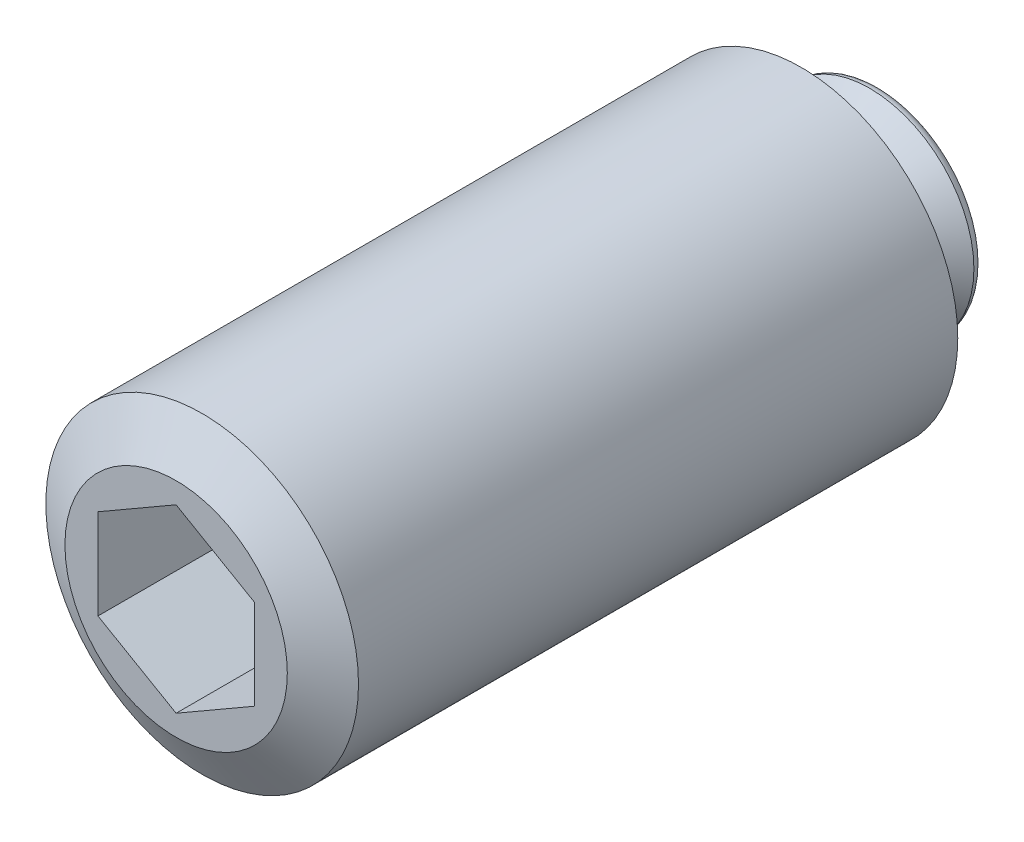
ISO-10303-21;
HEADER;
FILE_DESCRIPTION(('STEP AP214'),'2;1');
FILE_NAME('part.step','',(''),(''),'','','');
FILE_SCHEMA(('AUTOMOTIVE_DESIGN { 1 0 10303 214 1 1 1 1 }'));
ENDSEC;
DATA;
#1=APPLICATION_CONTEXT('core data for automotive mechanical design processes');
#2=APPLICATION_PROTOCOL_DEFINITION('international standard','automotive_design',2000,#1);
#3=PRODUCT_CONTEXT('',#1,'mechanical');
#4=PRODUCT('Part','Part','',(#3));
#5=PRODUCT_RELATED_PRODUCT_CATEGORY('part','',(#4));
#6=PRODUCT_DEFINITION_FORMATION('','',#4);
#7=PRODUCT_DEFINITION_CONTEXT('part definition',#1,'design');
#8=PRODUCT_DEFINITION('design','',#6,#7);
#9=PRODUCT_DEFINITION_SHAPE('','',#8);
#10=(LENGTH_UNIT() NAMED_UNIT(*) SI_UNIT(.MILLI.,.METRE.));
#11=(NAMED_UNIT(*) PLANE_ANGLE_UNIT() SI_UNIT($,.RADIAN.));
#12=(NAMED_UNIT(*) SI_UNIT($,.STERADIAN.) SOLID_ANGLE_UNIT());
#13=UNCERTAINTY_MEASURE_WITH_UNIT(LENGTH_MEASURE(1.E-05),#10,'distance_accuracy_value','');
#14=(GEOMETRIC_REPRESENTATION_CONTEXT(3) GLOBAL_UNCERTAINTY_ASSIGNED_CONTEXT((#13)) GLOBAL_UNIT_ASSIGNED_CONTEXT((#10,
#11,#12)) REPRESENTATION_CONTEXT('',''));
#15=CARTESIAN_POINT('',(0.,0.,0.));
#16=DIRECTION('',(0.,0.,1.));
#17=DIRECTION('',(1.,0.,0.));
#18=AXIS2_PLACEMENT_3D('',#15,#16,#17);
#19=CARTESIAN_POINT('',(0.,4.267949,27.));
#20=DIRECTION('',(0.,0.,1.));
#21=DIRECTION('',(1.,0.,0.));
#22=AXIS2_PLACEMENT_3D('',#19,#20,#21);
#23=PLANE('',#22);
#24=DIRECTION('',(-0.866025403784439,0.5,0.));
#25=VECTOR('',#24,1.);
#26=CARTESIAN_POINT('',(3.,1.73205080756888,27.));
#27=LINE('',#26,#25);
#28=CARTESIAN_POINT('',(3.,1.73205080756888,27.));
#29=VERTEX_POINT('',#28);
#30=CARTESIAN_POINT('',(0.,3.46410161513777,27.));
#31=VERTEX_POINT('',#30);
#32=EDGE_CURVE('E28',#29,#31,#27,.T.);
#33=ORIENTED_EDGE('',*,*,#32,.F.);
#34=DIRECTION('',(0.,1.,0.));
#35=VECTOR('',#34,1.);
#36=CARTESIAN_POINT('',(3.,-1.73205080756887,27.));
#37=LINE('',#36,#35);
#38=CARTESIAN_POINT('',(3.,-1.73205080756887,27.));
#39=VERTEX_POINT('',#38);
#40=EDGE_CURVE('E111',#39,#29,#37,.T.);
#41=ORIENTED_EDGE('',*,*,#40,.F.);
#42=DIRECTION('',(0.866025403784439,0.5,0.));
#43=VECTOR('',#42,1.);
#44=CARTESIAN_POINT('',(0.,-3.46410161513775,27.));
#45=LINE('',#44,#43);
#46=CARTESIAN_POINT('',(0.,-3.46410161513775,27.));
#47=VERTEX_POINT('',#46);
#48=EDGE_CURVE('E109',#47,#39,#45,.T.);
#49=ORIENTED_EDGE('',*,*,#48,.F.);
#50=DIRECTION('',(0.866025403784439,-0.5,0.));
#51=VECTOR('',#50,1.);
#52=CARTESIAN_POINT('',(-3.,-1.73205080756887,27.));
#53=LINE('',#52,#51);
#54=CARTESIAN_POINT('',(-3.,-1.73205080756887,27.));
#55=VERTEX_POINT('',#54);
#56=EDGE_CURVE('E76',#55,#47,#53,.T.);
#57=ORIENTED_EDGE('',*,*,#56,.F.);
#58=DIRECTION('',(0.,-1.,0.));
#59=VECTOR('',#58,1.);
#60=CARTESIAN_POINT('',(-3.,1.73205080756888,27.));
#61=LINE('',#60,#59);
#62=CARTESIAN_POINT('',(-3.,1.73205080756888,27.));
#63=VERTEX_POINT('',#62);
#64=EDGE_CURVE('E105',#63,#55,#61,.T.);
#65=ORIENTED_EDGE('',*,*,#64,.F.);
#66=DIRECTION('',(-0.866025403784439,-0.5,0.));
#67=VECTOR('',#66,1.);
#68=CARTESIAN_POINT('',(0.,3.46410161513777,27.));
#69=LINE('',#68,#67);
#70=EDGE_CURVE('E102',#31,#63,#69,.T.);
#71=ORIENTED_EDGE('',*,*,#70,.F.);
#72=EDGE_LOOP('',(#33,#41,#49,#57,#65,#71));
#73=FACE_BOUND('',#72,.T.);
#74=CARTESIAN_POINT('',(0.,0.,27.));
#75=DIRECTION('',(0.,0.,1.));
#76=DIRECTION('',(1.,0.,0.));
#77=AXIS2_PLACEMENT_3D('',#74,#75,#76);
#78=CIRCLE('',#77,4.267949);
#79=CARTESIAN_POINT('',(4.267949,0.,27.));
#80=VERTEX_POINT('',#79);
#81=EDGE_CURVE('E9',#80,#80,#78,.T.);
#82=ORIENTED_EDGE('',*,*,#81,.T.);
#83=EDGE_LOOP('',(#82));
#84=FACE_BOUND('',#83,.T.);
#85=ADVANCED_FACE('F14',(#73,#84),#23,.T.);
#86=CARTESIAN_POINT('',(0.,0.,27.));
#87=DIRECTION('',(0.,0.,-1.));
#88=DIRECTION('',(-1.,0.,0.));
#89=AXIS2_PLACEMENT_3D('',#86,#87,#88);
#90=CONICAL_SURFACE('',#89,4.267949,1.04719759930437);
#91=CARTESIAN_POINT('',(0.,0.,26.));
#92=DIRECTION('',(0.,0.,1.));
#93=DIRECTION('',(1.,0.,0.));
#94=AXIS2_PLACEMENT_3D('',#91,#92,#93);
#95=CIRCLE('',#94,6.);
#96=CARTESIAN_POINT('',(6.,0.,26.));
#97=VERTEX_POINT('',#96);
#98=EDGE_CURVE('E21',#97,#97,#95,.T.);
#99=ORIENTED_EDGE('',*,*,#98,.T.);
#100=EDGE_LOOP('',(#99));
#101=FACE_BOUND('',#100,.T.);
#102=ORIENTED_EDGE('',*,*,#81,.F.);
#103=EDGE_LOOP('',(#102));
#104=FACE_BOUND('',#103,.T.);
#105=ADVANCED_FACE('F143',(#101,#104),#90,.T.);
#106=CARTESIAN_POINT('',(0.,0.,30.));
#107=DIRECTION('',(0.,0.,1.));
#108=DIRECTION('',(1.,0.,0.));
#109=AXIS2_PLACEMENT_3D('',#106,#107,#108);
#110=CYLINDRICAL_SURFACE('',#109,6.);
#111=CARTESIAN_POINT('',(0.,0.,3.));
#112=DIRECTION('',(0.,0.,1.));
#113=DIRECTION('',(1.,0.,0.));
#114=AXIS2_PLACEMENT_3D('',#111,#112,#113);
#115=CIRCLE('',#114,6.);
#116=CARTESIAN_POINT('',(6.,0.,3.));
#117=VERTEX_POINT('',#116);
#118=EDGE_CURVE('E138',#117,#117,#115,.T.);
#119=ORIENTED_EDGE('',*,*,#118,.T.);
#120=EDGE_LOOP('',(#119));
#121=FACE_BOUND('',#120,.T.);
#122=ORIENTED_EDGE('',*,*,#98,.F.);
#123=EDGE_LOOP('',(#122));
#124=FACE_BOUND('',#123,.T.);
#125=ADVANCED_FACE('F146',(#121,#124),#110,.T.);
#126=CARTESIAN_POINT('',(0.,0.,3.));
#127=DIRECTION('',(0.,0.,1.));
#128=DIRECTION('',(1.,0.,0.));
#129=AXIS2_PLACEMENT_3D('',#126,#127,#128);
#130=CONICAL_SURFACE('',#129,6.,1.04719759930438);
#131=CARTESIAN_POINT('',(0.,0.,2.));
#132=DIRECTION('',(0.,0.,1.));
#133=DIRECTION('',(1.,0.,0.));
#134=AXIS2_PLACEMENT_3D('',#131,#132,#133);
#135=CIRCLE('',#134,4.267949);
#136=CARTESIAN_POINT('',(4.267949,0.,2.));
#137=VERTEX_POINT('',#136);
#138=EDGE_CURVE('E135',#137,#137,#135,.T.);
#139=ORIENTED_EDGE('',*,*,#138,.T.);
#140=EDGE_LOOP('',(#139));
#141=FACE_BOUND('',#140,.T.);
#142=ORIENTED_EDGE('',*,*,#118,.F.);
#143=EDGE_LOOP('',(#142));
#144=FACE_BOUND('',#143,.T.);
#145=ADVANCED_FACE('F148',(#141,#144),#130,.T.);
#146=CARTESIAN_POINT('',(0.,4.267949,2.));
#147=DIRECTION('',(0.,0.,-1.));
#148=DIRECTION('',(-1.,0.,0.));
#149=AXIS2_PLACEMENT_3D('',#146,#147,#148);
#150=PLANE('',#149);
#151=CARTESIAN_POINT('',(0.,0.,2.));
#152=DIRECTION('',(0.,0.,1.));
#153=DIRECTION('',(1.,0.,0.));
#154=AXIS2_PLACEMENT_3D('',#151,#152,#153);
#155=CIRCLE('',#154,3.);
#156=CARTESIAN_POINT('',(3.,0.,2.));
#157=VERTEX_POINT('',#156);
#158=EDGE_CURVE('E132',#157,#157,#155,.T.);
#159=ORIENTED_EDGE('',*,*,#158,.T.);
#160=EDGE_LOOP('',(#159));
#161=FACE_BOUND('',#160,.T.);
#162=ORIENTED_EDGE('',*,*,#138,.F.);
#163=EDGE_LOOP('',(#162));
#164=FACE_BOUND('',#163,.T.);
#165=ADVANCED_FACE('F157',(#161,#164),#150,.T.);
#166=CARTESIAN_POINT('',(0.,0.,30.));
#167=DIRECTION('',(0.,0.,1.));
#168=DIRECTION('',(1.,0.,0.));
#169=AXIS2_PLACEMENT_3D('',#166,#167,#168);
#170=CYLINDRICAL_SURFACE('',#169,3.);
#171=CARTESIAN_POINT('',(0.,0.,1.48621024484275));
#172=DIRECTION('',(0.,0.,1.));
#173=DIRECTION('',(1.,0.,0.));
#174=AXIS2_PLACEMENT_3D('',#171,#172,#173);
#175=CIRCLE('',#174,3.);
#176=CARTESIAN_POINT('',(3.,0.,1.48621024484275));
#177=VERTEX_POINT('',#176);
#178=EDGE_CURVE('E129',#177,#177,#175,.T.);
#179=ORIENTED_EDGE('',*,*,#178,.T.);
#180=EDGE_LOOP('',(#179));
#181=FACE_BOUND('',#180,.T.);
#182=ORIENTED_EDGE('',*,*,#158,.F.);
#183=EDGE_LOOP('',(#182));
#184=FACE_BOUND('',#183,.T.);
#185=ADVANCED_FACE('F200',(#181,#184),#170,.T.);
#186=CARTESIAN_POINT('',(0.,0.,1.48621024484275));
#187=DIRECTION('',(0.,0.,1.));
#188=DIRECTION('',(1.,0.,0.));
#189=AXIS2_PLACEMENT_3D('',#186,#187,#188);
#190=TOROIDAL_SURFACE('',#189,3.254,0.254000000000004);
#191=CARTESIAN_POINT('',(0.,0.,1.3066051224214));
#192=DIRECTION('',(0.,0.,1.));
#193=DIRECTION('',(1.,0.,0.));
#194=AXIS2_PLACEMENT_3D('',#191,#192,#193);
#195=CIRCLE('',#194,3.07439487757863);
#196=CARTESIAN_POINT('',(3.07439487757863,0.,1.3066051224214));
#197=VERTEX_POINT('',#196);
#198=EDGE_CURVE('E126',#197,#197,#195,.T.);
#199=ORIENTED_EDGE('',*,*,#198,.T.);
#200=EDGE_LOOP('',(#199));
#201=FACE_BOUND('',#200,.T.);
#202=ORIENTED_EDGE('',*,*,#178,.F.);
#203=EDGE_LOOP('',(#202));
#204=FACE_BOUND('',#203,.T.);
#205=ADVANCED_FACE('F196',(#201,#204),#190,.F.);
#206=CARTESIAN_POINT('',(0.,0.,1.3066051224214));
#207=DIRECTION('',(0.,0.,-1.));
#208=DIRECTION('',(-1.,0.,0.));
#209=AXIS2_PLACEMENT_3D('',#206,#207,#208);
#210=CONICAL_SURFACE('',#209,3.07439487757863,0.785398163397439);
#211=CARTESIAN_POINT('',(0.,0.,0.381));
#212=DIRECTION('',(0.,0.,1.));
#213=DIRECTION('',(1.,0.,0.));
#214=AXIS2_PLACEMENT_3D('',#211,#212,#213);
#215=CIRCLE('',#214,4.);
#216=CARTESIAN_POINT('',(4.,0.,0.381));
#217=VERTEX_POINT('',#216);
#218=EDGE_CURVE('E123',#217,#217,#215,.T.);
#219=ORIENTED_EDGE('',*,*,#218,.T.);
#220=EDGE_LOOP('',(#219));
#221=FACE_BOUND('',#220,.T.);
#222=ORIENTED_EDGE('',*,*,#198,.F.);
#223=EDGE_LOOP('',(#222));
#224=FACE_BOUND('',#223,.T.);
#225=ADVANCED_FACE('F192',(#221,#224),#210,.T.);
#226=CARTESIAN_POINT('',(0.,0.,0.381));
#227=DIRECTION('',(0.,0.,1.));
#228=DIRECTION('',(1.,0.,0.));
#229=AXIS2_PLACEMENT_3D('',#226,#227,#228);
#230=TOROIDAL_SURFACE('',#229,3.619,0.381);
#231=CARTESIAN_POINT('',(0.,0.,0.));
#232=DIRECTION('',(0.,0.,1.));
#233=DIRECTION('',(1.,0.,0.));
#234=AXIS2_PLACEMENT_3D('',#231,#232,#233);
#235=CIRCLE('',#234,3.619);
#236=CARTESIAN_POINT('',(3.619,0.,0.));
#237=VERTEX_POINT('',#236);
#238=EDGE_CURVE('E115',#237,#237,#235,.T.);
#239=ORIENTED_EDGE('',*,*,#238,.T.);
#240=EDGE_LOOP('',(#239));
#241=FACE_BOUND('',#240,.T.);
#242=ORIENTED_EDGE('',*,*,#218,.F.);
#243=EDGE_LOOP('',(#242));
#244=FACE_BOUND('',#243,.T.);
#245=ADVANCED_FACE('F184',(#241,#244),#230,.T.);
#246=CARTESIAN_POINT('',(0.,0.,0.));
#247=DIRECTION('',(0.,0.,-1.));
#248=DIRECTION('',(-1.,0.,0.));
#249=AXIS2_PLACEMENT_3D('',#246,#247,#248);
#250=PLANE('',#249);
#251=ORIENTED_EDGE('',*,*,#238,.F.);
#252=EDGE_LOOP('',(#251));
#253=FACE_BOUND('',#252,.T.);
#254=ADVANCED_FACE('F176',(#253),#250,.T.);
#255=CARTESIAN_POINT('',(3.,1.73205080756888,22.));
#256=DIRECTION('',(0.5,0.866025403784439,0.));
#257=DIRECTION('',(0.866025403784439,-0.5,0.));
#258=AXIS2_PLACEMENT_3D('',#255,#256,#257);
#259=PLANE('',#258);
#260=ORIENTED_EDGE('',*,*,#32,.T.);
#261=DIRECTION('',(0.,0.,1.));
#262=VECTOR('',#261,1.);
#263=CARTESIAN_POINT('',(0.,3.46410161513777,22.));
#264=LINE('',#263,#262);
#265=CARTESIAN_POINT('',(0.,3.46410161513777,22.));
#266=VERTEX_POINT('',#265);
#267=EDGE_CURVE('E58',#266,#31,#264,.T.);
#268=ORIENTED_EDGE('',*,*,#267,.F.);
#269=DIRECTION('',(-0.866025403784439,0.5,0.));
#270=VECTOR('',#269,1.);
#271=CARTESIAN_POINT('',(3.,1.73205080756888,22.));
#272=LINE('',#271,#270);
#273=CARTESIAN_POINT('',(3.,1.73205080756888,22.));
#274=VERTEX_POINT('',#273);
#275=EDGE_CURVE('E113',#274,#266,#272,.T.);
#276=ORIENTED_EDGE('',*,*,#275,.F.);
#277=DIRECTION('',(0.,0.,1.));
#278=VECTOR('',#277,1.);
#279=CARTESIAN_POINT('',(3.,1.73205080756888,22.));
#280=LINE('',#279,#278);
#281=EDGE_CURVE('E36',#274,#29,#280,.T.);
#282=ORIENTED_EDGE('',*,*,#281,.T.);
#283=EDGE_LOOP('',(#260,#268,#276,#282));
#284=FACE_BOUND('',#283,.T.);
#285=ADVANCED_FACE('F173',(#284),#259,.F.);
#286=CARTESIAN_POINT('',(3.,-1.73205080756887,22.));
#287=DIRECTION('',(1.,0.,0.));
#288=DIRECTION('',(0.,0.,-1.));
#289=AXIS2_PLACEMENT_3D('',#286,#287,#288);
#290=PLANE('',#289);
#291=ORIENTED_EDGE('',*,*,#40,.T.);
#292=ORIENTED_EDGE('',*,*,#281,.F.);
#293=DIRECTION('',(0.,1.,0.));
#294=VECTOR('',#293,1.);
#295=CARTESIAN_POINT('',(3.,-1.73205080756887,22.));
#296=LINE('',#295,#294);
#297=CARTESIAN_POINT('',(3.,-1.73205080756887,22.));
#298=VERTEX_POINT('',#297);
#299=EDGE_CURVE('E88',#298,#274,#296,.T.);
#300=ORIENTED_EDGE('',*,*,#299,.F.);
#301=DIRECTION('',(0.,0.,1.));
#302=VECTOR('',#301,1.);
#303=CARTESIAN_POINT('',(3.,-1.73205080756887,22.));
#304=LINE('',#303,#302);
#305=EDGE_CURVE('E80',#298,#39,#304,.T.);
#306=ORIENTED_EDGE('',*,*,#305,.T.);
#307=EDGE_LOOP('',(#291,#292,#300,#306));
#308=FACE_BOUND('',#307,.T.);
#309=ADVANCED_FACE('F175',(#308),#290,.F.);
#310=CARTESIAN_POINT('',(0.,-3.46410161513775,22.));
#311=DIRECTION('',(0.5,-0.866025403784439,0.));
#312=DIRECTION('',(-0.866025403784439,-0.5,0.));
#313=AXIS2_PLACEMENT_3D('',#310,#311,#312);
#314=PLANE('',#313);
#315=ORIENTED_EDGE('',*,*,#48,.T.);
#316=ORIENTED_EDGE('',*,*,#305,.F.);
#317=DIRECTION('',(0.866025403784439,0.5,0.));
#318=VECTOR('',#317,1.);
#319=CARTESIAN_POINT('',(0.,-3.46410161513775,22.));
#320=LINE('',#319,#318);
#321=CARTESIAN_POINT('',(0.,-3.46410161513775,22.));
#322=VERTEX_POINT('',#321);
#323=EDGE_CURVE('E84',#322,#298,#320,.T.);
#324=ORIENTED_EDGE('',*,*,#323,.F.);
#325=DIRECTION('',(0.,0.,1.));
#326=VECTOR('',#325,1.);
#327=CARTESIAN_POINT('',(0.,-3.46410161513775,22.));
#328=LINE('',#327,#326);
#329=EDGE_CURVE('E69',#322,#47,#328,.T.);
#330=ORIENTED_EDGE('',*,*,#329,.T.);
#331=EDGE_LOOP('',(#315,#316,#324,#330));
#332=FACE_BOUND('',#331,.T.);
#333=ADVANCED_FACE('F85',(#332),#314,.F.);
#334=CARTESIAN_POINT('',(-3.,-1.73205080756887,22.));
#335=DIRECTION('',(-0.5,-0.866025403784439,0.));
#336=DIRECTION('',(-0.866025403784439,0.5,0.));
#337=AXIS2_PLACEMENT_3D('',#334,#335,#336);
#338=PLANE('',#337);
#339=ORIENTED_EDGE('',*,*,#56,.T.);
#340=ORIENTED_EDGE('',*,*,#329,.F.);
#341=DIRECTION('',(0.866025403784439,-0.5,0.));
#342=VECTOR('',#341,1.);
#343=CARTESIAN_POINT('',(-3.,-1.73205080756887,22.));
#344=LINE('',#343,#342);
#345=CARTESIAN_POINT('',(-3.,-1.73205080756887,22.));
#346=VERTEX_POINT('',#345);
#347=EDGE_CURVE('E73',#346,#322,#344,.T.);
#348=ORIENTED_EDGE('',*,*,#347,.F.);
#349=DIRECTION('',(0.,0.,1.));
#350=VECTOR('',#349,1.);
#351=CARTESIAN_POINT('',(-3.,-1.73205080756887,22.));
#352=LINE('',#351,#350);
#353=EDGE_CURVE('E81',#346,#55,#352,.T.);
#354=ORIENTED_EDGE('',*,*,#353,.T.);
#355=EDGE_LOOP('',(#339,#340,#348,#354));
#356=FACE_BOUND('',#355,.T.);
#357=ADVANCED_FACE('F71',(#356),#338,.F.);
#358=CARTESIAN_POINT('',(-3.,1.73205080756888,22.));
#359=DIRECTION('',(-1.,0.,0.));
#360=DIRECTION('',(0.,0.,1.));
#361=AXIS2_PLACEMENT_3D('',#358,#359,#360);
#362=PLANE('',#361);
#363=ORIENTED_EDGE('',*,*,#64,.T.);
#364=ORIENTED_EDGE('',*,*,#353,.F.);
#365=DIRECTION('',(0.,-1.,0.));
#366=VECTOR('',#365,1.);
#367=CARTESIAN_POINT('',(-3.,1.73205080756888,22.));
#368=LINE('',#367,#366);
#369=CARTESIAN_POINT('',(-3.,1.73205080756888,22.));
#370=VERTEX_POINT('',#369);
#371=EDGE_CURVE('E94',#370,#346,#368,.T.);
#372=ORIENTED_EDGE('',*,*,#371,.F.);
#373=DIRECTION('',(0.,0.,1.));
#374=VECTOR('',#373,1.);
#375=CARTESIAN_POINT('',(-3.,1.73205080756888,22.));
#376=LINE('',#375,#374);
#377=EDGE_CURVE('E118',#370,#63,#376,.T.);
#378=ORIENTED_EDGE('',*,*,#377,.T.);
#379=EDGE_LOOP('',(#363,#364,#372,#378));
#380=FACE_BOUND('',#379,.T.);
#381=ADVANCED_FACE('F295',(#380),#362,.F.);
#382=CARTESIAN_POINT('',(0.,3.46410161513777,22.));
#383=DIRECTION('',(-0.5,0.866025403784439,0.));
#384=DIRECTION('',(0.866025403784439,0.5,0.));
#385=AXIS2_PLACEMENT_3D('',#382,#383,#384);
#386=PLANE('',#385);
#387=ORIENTED_EDGE('',*,*,#70,.T.);
#388=ORIENTED_EDGE('',*,*,#377,.F.);
#389=DIRECTION('',(-0.866025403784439,-0.5,0.));
#390=VECTOR('',#389,1.);
#391=CARTESIAN_POINT('',(0.,3.46410161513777,22.));
#392=LINE('',#391,#390);
#393=EDGE_CURVE('E96',#266,#370,#392,.T.);
#394=ORIENTED_EDGE('',*,*,#393,.F.);
#395=ORIENTED_EDGE('',*,*,#267,.T.);
#396=EDGE_LOOP('',(#387,#388,#394,#395));
#397=FACE_BOUND('',#396,.T.);
#398=ADVANCED_FACE('F171',(#397),#386,.F.);
#399=CARTESIAN_POINT('',(0.,3.46410161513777,22.));
#400=DIRECTION('',(0.,0.,1.));
#401=DIRECTION('',(1.,0.,0.));
#402=AXIS2_PLACEMENT_3D('',#399,#400,#401);
#403=PLANE('',#402);
#404=ORIENTED_EDGE('',*,*,#275,.T.);
#405=ORIENTED_EDGE('',*,*,#393,.T.);
#406=ORIENTED_EDGE('',*,*,#371,.T.);
#407=ORIENTED_EDGE('',*,*,#347,.T.);
#408=ORIENTED_EDGE('',*,*,#323,.T.);
#409=ORIENTED_EDGE('',*,*,#299,.T.);
#410=EDGE_LOOP('',(#404,#405,#406,#407,#408,#409));
#411=FACE_BOUND('',#410,.T.);
#412=ADVANCED_FACE('F91',(#411),#403,.T.);
#413=CLOSED_SHELL('',(#85,#105,#125,#145,#165,#185,#205,#225,#245,#254,#285,#309,#333,#357,#381,
#398,#412));
#414=MANIFOLD_SOLID_BREP('B1',#413);
#415=ADVANCED_BREP_SHAPE_REPRESENTATION('',(#18,#414),#14);
#416=SHAPE_DEFINITION_REPRESENTATION(#9,#415);
ENDSEC;
END-ISO-10303-21;
